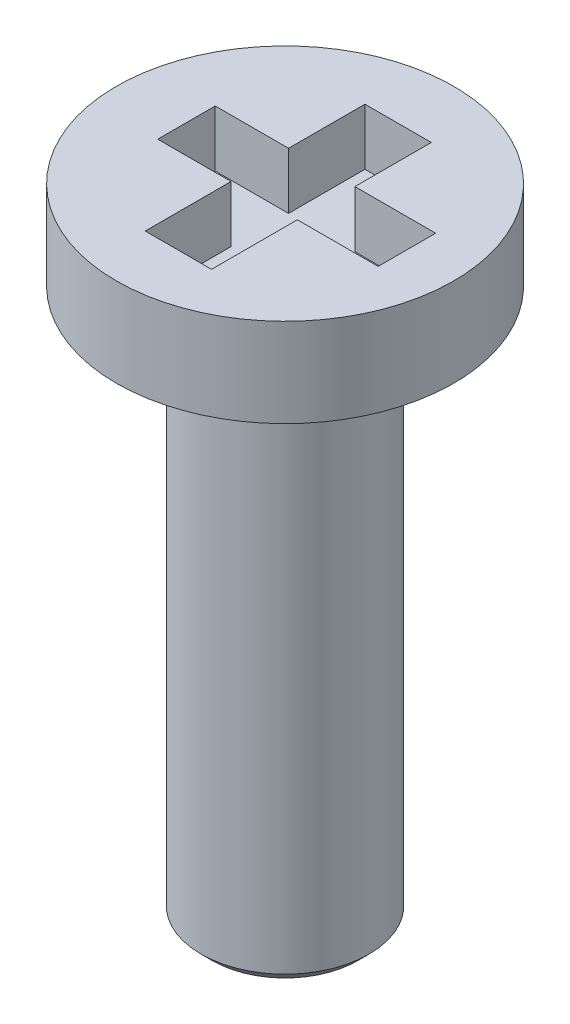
from build123d import *

# Parameters (mm, degrees)
EXTRUSION1_DEPTH = 1
CHANFREIN1_SIZE  = 0.2


with BuildPart() as part:
    # Esquisse1 → R_volution1 (revolve)
    with BuildSketch(Plane.XY, mode=Mode.PRIVATE) as r_volution1_sk:
        Polygon((0, 0), (1.49, 0), (1.49, 9.714705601), (2.99, 9.714705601), (2.99, 11.286699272), (0, 11.286699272), (0, 7), align=None)
    revolve(r_volution1_sk.sketch.rotate(Axis((0, 19.620409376, 0), (0, -1, 0)), 90), axis=Axis((0, 19.620409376, 0), (0, -1, 0)))

    # Esquisse2 → Extrusion1 (cut)
    with BuildSketch(Plane(origin=(0, 11.286699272, 0), x_dir=(1, 0, 0), z_dir=(0, 1, 0))):
        Polygon((0.664381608, 0.573573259), (2.096539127, 0.573573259), (2.096539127, -0.446429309), (0.664381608, -0.446429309), (0.664381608, -1.967671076), (-0.511697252, -1.967671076), (-0.511697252, -0.446429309), (-1.811400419, -0.446429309), (-1.811400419, 0.573573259), (-0.511697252, 0.573573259), (-0.511697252, 1.927860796), (0.664381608, 1.927860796), align=None)
    extrude(amount=-EXTRUSION1_DEPTH, mode=Mode.SUBTRACT)

    # Chanfrein1
    chanfrein1_edges = [part.edges().sort_by_distance(p)[0] for p in [
        (0, 0, -1.49),
    ]]
    chamfer(chanfrein1_edges, length=CHANFREIN1_SIZE)


solid = part.part
